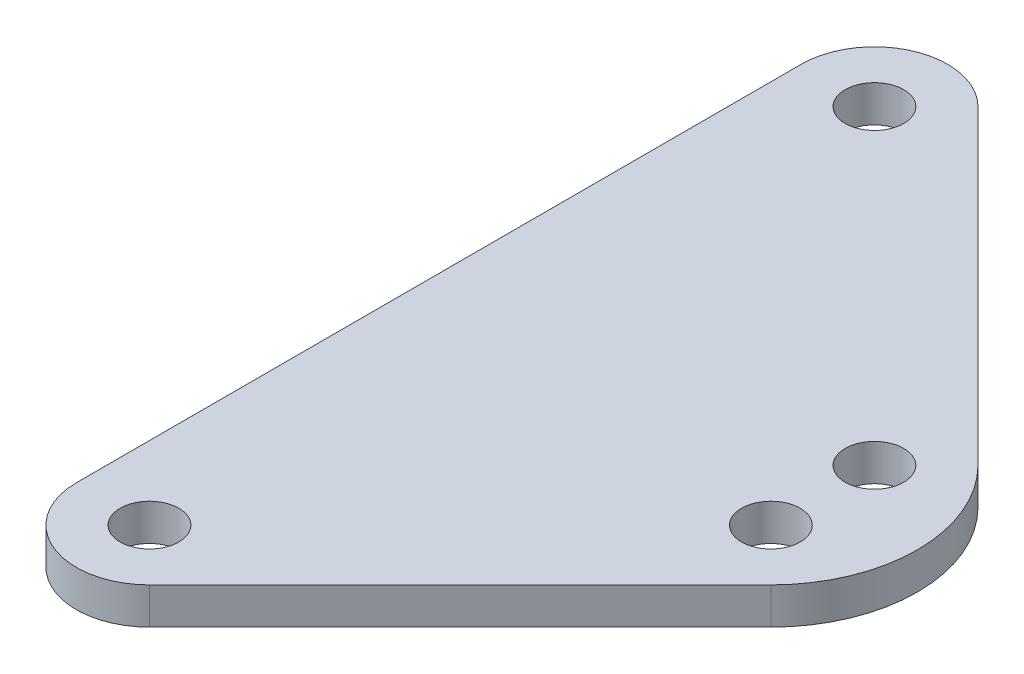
ISO-10303-21;
HEADER;
FILE_DESCRIPTION(('STEP AP214'),'2;1');
FILE_NAME('part.step','',(''),(''),'','','');
FILE_SCHEMA(('AUTOMOTIVE_DESIGN { 1 0 10303 214 1 1 1 1 }'));
ENDSEC;
DATA;
#1=APPLICATION_CONTEXT('core data for automotive mechanical design processes');
#2=APPLICATION_PROTOCOL_DEFINITION('international standard','automotive_design',2000,#1);
#3=PRODUCT_CONTEXT('',#1,'mechanical');
#4=PRODUCT('Part','Part','',(#3));
#5=PRODUCT_RELATED_PRODUCT_CATEGORY('part','',(#4));
#6=PRODUCT_DEFINITION_FORMATION('','',#4);
#7=PRODUCT_DEFINITION_CONTEXT('part definition',#1,'design');
#8=PRODUCT_DEFINITION('design','',#6,#7);
#9=PRODUCT_DEFINITION_SHAPE('','',#8);
#10=(LENGTH_UNIT() NAMED_UNIT(*) SI_UNIT(.MILLI.,.METRE.));
#11=(NAMED_UNIT(*) PLANE_ANGLE_UNIT() SI_UNIT($,.RADIAN.));
#12=(NAMED_UNIT(*) SI_UNIT($,.STERADIAN.) SOLID_ANGLE_UNIT());
#13=UNCERTAINTY_MEASURE_WITH_UNIT(LENGTH_MEASURE(1.E-05),#10,'distance_accuracy_value','');
#14=(GEOMETRIC_REPRESENTATION_CONTEXT(3) GLOBAL_UNCERTAINTY_ASSIGNED_CONTEXT((#13)) GLOBAL_UNIT_ASSIGNED_CONTEXT((#10,
#11,#12)) REPRESENTATION_CONTEXT('',''));
#15=CARTESIAN_POINT('',(0.,0.,0.));
#16=DIRECTION('',(0.,0.,1.));
#17=DIRECTION('',(1.,0.,0.));
#18=AXIS2_PLACEMENT_3D('',#15,#16,#17);
#19=CARTESIAN_POINT('',(90.7106781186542,10.,-147.279220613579));
#20=DIRECTION('',(0.,1.,0.));
#21=DIRECTION('',(0.,0.,1.));
#22=AXIS2_PLACEMENT_3D('',#19,#20,#21);
#23=PLANE('',#22);
#24=CARTESIAN_POINT('',(104.852813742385,10.,-161.42135623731));
#25=DIRECTION('',(0.,1.,0.));
#26=DIRECTION('',(0.,0.,1.));
#27=AXIS2_PLACEMENT_3D('',#24,#25,#26);
#28=CIRCLE('',#27,7.99999999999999);
#29=CARTESIAN_POINT('',(104.852813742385,10.,-153.42135623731));
#30=VERTEX_POINT('',#29);
#31=EDGE_CURVE('E194',#30,#30,#28,.T.);
#32=ORIENTED_EDGE('',*,*,#31,.F.);
#33=EDGE_LOOP('',(#32));
#34=FACE_BOUND('',#33,.T.);
#35=CARTESIAN_POINT('',(20.,10.,-48.2842712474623));
#36=DIRECTION('',(0.,1.,0.));
#37=DIRECTION('',(0.,0.,1.));
#38=AXIS2_PLACEMENT_3D('',#35,#36,#37);
#39=CIRCLE('',#38,8.);
#40=CARTESIAN_POINT('',(20.,10.,-40.2842712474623));
#41=VERTEX_POINT('',#40);
#42=EDGE_CURVE('E127',#41,#41,#39,.T.);
#43=ORIENTED_EDGE('',*,*,#42,.F.);
#44=EDGE_LOOP('',(#43));
#45=FACE_BOUND('',#44,.T.);
#46=CARTESIAN_POINT('',(90.7106781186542,10.,-147.279220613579));
#47=DIRECTION('',(0.,1.,0.));
#48=DIRECTION('',(0.,0.,1.));
#49=AXIS2_PLACEMENT_3D('',#46,#47,#48);
#50=CIRCLE('',#49,40.);
#51=CARTESIAN_POINT('',(118.994949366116,10.,-118.994949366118));
#52=VERTEX_POINT('',#51);
#53=CARTESIAN_POINT('',(118.994949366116,10.,-175.563491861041));
#54=VERTEX_POINT('',#53);
#55=EDGE_CURVE('E134',#52,#54,#50,.T.);
#56=ORIENTED_EDGE('',*,*,#55,.T.);
#57=DIRECTION('',(-0.707106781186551,0.,-0.707106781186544));
#58=VECTOR('',#57,1.);
#59=CARTESIAN_POINT('',(118.994949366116,10.,-175.563491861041));
#60=LINE('',#59,#58);
#61=CARTESIAN_POINT('',(34.1421356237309,10.,-260.416305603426));
#62=VERTEX_POINT('',#61);
#63=EDGE_CURVE('E92',#54,#62,#60,.T.);
#64=ORIENTED_EDGE('',*,*,#63,.T.);
#65=CARTESIAN_POINT('',(20.,10.,-246.274169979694));
#66=DIRECTION('',(0.,1.,0.));
#67=DIRECTION('',(0.,0.,1.));
#68=AXIS2_PLACEMENT_3D('',#65,#66,#67);
#69=CIRCLE('',#68,20.);
#70=CARTESIAN_POINT('',(0.,10.,-246.274169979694));
#71=VERTEX_POINT('',#70);
#72=EDGE_CURVE('E105',#62,#71,#69,.T.);
#73=ORIENTED_EDGE('',*,*,#72,.T.);
#74=DIRECTION('',(0.,0.,1.));
#75=VECTOR('',#74,1.);
#76=CARTESIAN_POINT('',(0.,10.,-246.274169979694));
#77=LINE('',#76,#75);
#78=CARTESIAN_POINT('',(0.,10.,-48.2842712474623));
#79=VERTEX_POINT('',#78);
#80=EDGE_CURVE('E99',#71,#79,#77,.T.);
#81=ORIENTED_EDGE('',*,*,#80,.T.);
#82=CARTESIAN_POINT('',(20.,10.,-48.2842712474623));
#83=DIRECTION('',(0.,1.,0.));
#84=DIRECTION('',(0.,0.,-1.));
#85=AXIS2_PLACEMENT_3D('',#82,#83,#84);
#86=CIRCLE('',#85,20.);
#87=CARTESIAN_POINT('',(34.1421356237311,10.,-34.1421356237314));
#88=VERTEX_POINT('',#87);
#89=EDGE_CURVE('E103',#79,#88,#86,.T.);
#90=ORIENTED_EDGE('',*,*,#89,.T.);
#91=DIRECTION('',(0.707106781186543,0.,-0.707106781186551));
#92=VECTOR('',#91,1.);
#93=CARTESIAN_POINT('',(34.1421356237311,10.,-34.1421356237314));
#94=LINE('',#93,#92);
#95=EDGE_CURVE('E55',#88,#52,#94,.T.);
#96=ORIENTED_EDGE('',*,*,#95,.T.);
#97=EDGE_LOOP('',(#56,#64,#73,#81,#90,#96));
#98=FACE_BOUND('',#97,.T.);
#99=CARTESIAN_POINT('',(104.852813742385,10.,-133.137084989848));
#100=DIRECTION('',(0.,1.,0.));
#101=DIRECTION('',(0.,0.,1.));
#102=AXIS2_PLACEMENT_3D('',#99,#100,#101);
#103=CIRCLE('',#102,8.00000000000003);
#104=CARTESIAN_POINT('',(104.852813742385,10.,-125.137084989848));
#105=VERTEX_POINT('',#104);
#106=EDGE_CURVE('E200',#105,#105,#103,.T.);
#107=ORIENTED_EDGE('',*,*,#106,.F.);
#108=EDGE_LOOP('',(#107));
#109=FACE_BOUND('',#108,.T.);
#110=CARTESIAN_POINT('',(19.9999999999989,10.,-246.274169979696));
#111=DIRECTION('',(0.,1.,0.));
#112=DIRECTION('',(0.,0.,1.));
#113=AXIS2_PLACEMENT_3D('',#110,#111,#112);
#114=CIRCLE('',#113,7.99999999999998);
#115=CARTESIAN_POINT('',(19.9999999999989,10.,-238.274169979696));
#116=VERTEX_POINT('',#115);
#117=EDGE_CURVE('E185',#116,#116,#114,.T.);
#118=ORIENTED_EDGE('',*,*,#117,.F.);
#119=EDGE_LOOP('',(#118));
#120=FACE_BOUND('',#119,.T.);
#121=ADVANCED_FACE('F38',(#34,#45,#98,#109,#120),#23,.T.);
#122=CARTESIAN_POINT('',(90.7106781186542,0.,-147.279220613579));
#123=DIRECTION('',(0.,1.,0.));
#124=DIRECTION('',(0.,0.,1.));
#125=AXIS2_PLACEMENT_3D('',#122,#123,#124);
#126=PLANE('',#125);
#127=CARTESIAN_POINT('',(90.7106781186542,0.,-147.279220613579));
#128=DIRECTION('',(0.,1.,0.));
#129=DIRECTION('',(0.,0.,1.));
#130=AXIS2_PLACEMENT_3D('',#127,#128,#129);
#131=CIRCLE('',#130,40.);
#132=CARTESIAN_POINT('',(118.994949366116,0.,-118.994949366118));
#133=VERTEX_POINT('',#132);
#134=CARTESIAN_POINT('',(118.994949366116,0.,-175.563491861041));
#135=VERTEX_POINT('',#134);
#136=EDGE_CURVE('E123',#133,#135,#131,.T.);
#137=ORIENTED_EDGE('',*,*,#136,.F.);
#138=DIRECTION('',(0.707106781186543,0.,-0.707106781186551));
#139=VECTOR('',#138,1.);
#140=CARTESIAN_POINT('',(34.1421356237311,0.,-34.1421356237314));
#141=LINE('',#140,#139);
#142=CARTESIAN_POINT('',(34.1421356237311,0.,-34.1421356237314));
#143=VERTEX_POINT('',#142);
#144=EDGE_CURVE('E84',#143,#133,#141,.T.);
#145=ORIENTED_EDGE('',*,*,#144,.F.);
#146=CARTESIAN_POINT('',(20.,0.,-48.2842712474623));
#147=DIRECTION('',(0.,1.,0.));
#148=DIRECTION('',(0.,0.,-1.));
#149=AXIS2_PLACEMENT_3D('',#146,#147,#148);
#150=CIRCLE('',#149,20.);
#151=CARTESIAN_POINT('',(0.,0.,-48.2842712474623));
#152=VERTEX_POINT('',#151);
#153=EDGE_CURVE('E78',#152,#143,#150,.T.);
#154=ORIENTED_EDGE('',*,*,#153,.F.);
#155=DIRECTION('',(0.,0.,1.));
#156=VECTOR('',#155,1.);
#157=CARTESIAN_POINT('',(0.,0.,-246.274169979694));
#158=LINE('',#157,#156);
#159=CARTESIAN_POINT('',(0.,0.,-246.274169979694));
#160=VERTEX_POINT('',#159);
#161=EDGE_CURVE('E113',#160,#152,#158,.T.);
#162=ORIENTED_EDGE('',*,*,#161,.F.);
#163=CARTESIAN_POINT('',(20.,0.,-246.274169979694));
#164=DIRECTION('',(0.,1.,0.));
#165=DIRECTION('',(0.,0.,1.));
#166=AXIS2_PLACEMENT_3D('',#163,#164,#165);
#167=CIRCLE('',#166,20.);
#168=CARTESIAN_POINT('',(34.1421356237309,0.,-260.416305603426));
#169=VERTEX_POINT('',#168);
#170=EDGE_CURVE('E129',#169,#160,#167,.T.);
#171=ORIENTED_EDGE('',*,*,#170,.F.);
#172=DIRECTION('',(-0.707106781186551,0.,-0.707106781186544));
#173=VECTOR('',#172,1.);
#174=CARTESIAN_POINT('',(118.994949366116,0.,-175.563491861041));
#175=LINE('',#174,#173);
#176=EDGE_CURVE('E126',#135,#169,#175,.T.);
#177=ORIENTED_EDGE('',*,*,#176,.F.);
#178=EDGE_LOOP('',(#137,#145,#154,#162,#171,#177));
#179=FACE_BOUND('',#178,.T.);
#180=CARTESIAN_POINT('',(20.,0.,-48.2842712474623));
#181=DIRECTION('',(0.,1.,0.));
#182=DIRECTION('',(0.,0.,1.));
#183=AXIS2_PLACEMENT_3D('',#180,#181,#182);
#184=CIRCLE('',#183,8.);
#185=CARTESIAN_POINT('',(20.,0.,-40.2842712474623));
#186=VERTEX_POINT('',#185);
#187=EDGE_CURVE('E203',#186,#186,#184,.T.);
#188=ORIENTED_EDGE('',*,*,#187,.T.);
#189=EDGE_LOOP('',(#188));
#190=FACE_BOUND('',#189,.T.);
#191=CARTESIAN_POINT('',(104.852813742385,0.,-133.137084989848));
#192=DIRECTION('',(0.,1.,0.));
#193=DIRECTION('',(0.,0.,1.));
#194=AXIS2_PLACEMENT_3D('',#191,#192,#193);
#195=CIRCLE('',#194,8.00000000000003);
#196=CARTESIAN_POINT('',(104.852813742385,0.,-125.137084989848));
#197=VERTEX_POINT('',#196);
#198=EDGE_CURVE('E197',#197,#197,#195,.T.);
#199=ORIENTED_EDGE('',*,*,#198,.T.);
#200=EDGE_LOOP('',(#199));
#201=FACE_BOUND('',#200,.T.);
#202=CARTESIAN_POINT('',(104.852813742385,0.,-161.42135623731));
#203=DIRECTION('',(0.,1.,0.));
#204=DIRECTION('',(0.,0.,1.));
#205=AXIS2_PLACEMENT_3D('',#202,#203,#204);
#206=CIRCLE('',#205,7.99999999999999);
#207=CARTESIAN_POINT('',(104.852813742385,0.,-153.42135623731));
#208=VERTEX_POINT('',#207);
#209=EDGE_CURVE('E191',#208,#208,#206,.T.);
#210=ORIENTED_EDGE('',*,*,#209,.T.);
#211=EDGE_LOOP('',(#210));
#212=FACE_BOUND('',#211,.T.);
#213=CARTESIAN_POINT('',(19.9999999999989,0.,-246.274169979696));
#214=DIRECTION('',(0.,1.,0.));
#215=DIRECTION('',(0.,0.,1.));
#216=AXIS2_PLACEMENT_3D('',#213,#214,#215);
#217=CIRCLE('',#216,7.99999999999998);
#218=CARTESIAN_POINT('',(19.9999999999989,0.,-238.274169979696));
#219=VERTEX_POINT('',#218);
#220=EDGE_CURVE('E188',#219,#219,#217,.T.);
#221=ORIENTED_EDGE('',*,*,#220,.T.);
#222=EDGE_LOOP('',(#221));
#223=FACE_BOUND('',#222,.T.);
#224=ADVANCED_FACE('F143',(#179,#190,#201,#212,#223),#126,.F.);
#225=CARTESIAN_POINT('',(90.7106781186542,10.,-147.279220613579));
#226=DIRECTION('',(0.,-1.,0.));
#227=DIRECTION('',(0.,0.,-1.));
#228=AXIS2_PLACEMENT_3D('',#225,#226,#227);
#229=CYLINDRICAL_SURFACE('',#228,40.);
#230=ORIENTED_EDGE('',*,*,#136,.T.);
#231=DIRECTION('',(0.,-1.,0.));
#232=VECTOR('',#231,1.);
#233=CARTESIAN_POINT('',(118.994949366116,10.,-175.563491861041));
#234=LINE('',#233,#232);
#235=EDGE_CURVE('E11',#54,#135,#234,.T.);
#236=ORIENTED_EDGE('',*,*,#235,.F.);
#237=ORIENTED_EDGE('',*,*,#55,.F.);
#238=DIRECTION('',(0.,-1.,0.));
#239=VECTOR('',#238,1.);
#240=CARTESIAN_POINT('',(118.994949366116,10.,-118.994949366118));
#241=LINE('',#240,#239);
#242=EDGE_CURVE('E119',#52,#133,#241,.T.);
#243=ORIENTED_EDGE('',*,*,#242,.T.);
#244=EDGE_LOOP('',(#230,#236,#237,#243));
#245=FACE_BOUND('',#244,.T.);
#246=ADVANCED_FACE('F40',(#245),#229,.T.);
#247=CARTESIAN_POINT('',(118.994949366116,10.,-175.563491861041));
#248=DIRECTION('',(-0.707106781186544,0.,0.707106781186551));
#249=DIRECTION('',(0.707106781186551,0.,0.707106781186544));
#250=AXIS2_PLACEMENT_3D('',#247,#248,#249);
#251=PLANE('',#250);
#252=ORIENTED_EDGE('',*,*,#176,.T.);
#253=DIRECTION('',(0.,-1.,0.));
#254=VECTOR('',#253,1.);
#255=CARTESIAN_POINT('',(34.1421356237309,10.,-260.416305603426));
#256=LINE('',#255,#254);
#257=EDGE_CURVE('E47',#62,#169,#256,.T.);
#258=ORIENTED_EDGE('',*,*,#257,.F.);
#259=ORIENTED_EDGE('',*,*,#63,.F.);
#260=ORIENTED_EDGE('',*,*,#235,.T.);
#261=EDGE_LOOP('',(#252,#258,#259,#260));
#262=FACE_BOUND('',#261,.T.);
#263=ADVANCED_FACE('F261',(#262),#251,.F.);
#264=CARTESIAN_POINT('',(20.,10.,-246.274169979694));
#265=DIRECTION('',(0.,-1.,0.));
#266=DIRECTION('',(0.,0.,-1.));
#267=AXIS2_PLACEMENT_3D('',#264,#265,#266);
#268=CYLINDRICAL_SURFACE('',#267,20.);
#269=ORIENTED_EDGE('',*,*,#170,.T.);
#270=DIRECTION('',(0.,-1.,0.));
#271=VECTOR('',#270,1.);
#272=CARTESIAN_POINT('',(0.,10.,-246.274169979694));
#273=LINE('',#272,#271);
#274=EDGE_CURVE('E114',#71,#160,#273,.T.);
#275=ORIENTED_EDGE('',*,*,#274,.F.);
#276=ORIENTED_EDGE('',*,*,#72,.F.);
#277=ORIENTED_EDGE('',*,*,#257,.T.);
#278=EDGE_LOOP('',(#269,#275,#276,#277));
#279=FACE_BOUND('',#278,.T.);
#280=ADVANCED_FACE('F140',(#279),#268,.T.);
#281=CARTESIAN_POINT('',(0.,10.,-246.274169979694));
#282=DIRECTION('',(1.,0.,0.));
#283=DIRECTION('',(0.,0.,-1.));
#284=AXIS2_PLACEMENT_3D('',#281,#282,#283);
#285=PLANE('',#284);
#286=ORIENTED_EDGE('',*,*,#161,.T.);
#287=DIRECTION('',(0.,-1.,0.));
#288=VECTOR('',#287,1.);
#289=CARTESIAN_POINT('',(0.,10.,-48.2842712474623));
#290=LINE('',#289,#288);
#291=EDGE_CURVE('E110',#79,#152,#290,.T.);
#292=ORIENTED_EDGE('',*,*,#291,.F.);
#293=ORIENTED_EDGE('',*,*,#80,.F.);
#294=ORIENTED_EDGE('',*,*,#274,.T.);
#295=EDGE_LOOP('',(#286,#292,#293,#294));
#296=FACE_BOUND('',#295,.T.);
#297=ADVANCED_FACE('F111',(#296),#285,.F.);
#298=CARTESIAN_POINT('',(20.,10.,-48.2842712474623));
#299=DIRECTION('',(0.,-1.,0.));
#300=DIRECTION('',(0.,0.,-1.));
#301=AXIS2_PLACEMENT_3D('',#298,#299,#300);
#302=CYLINDRICAL_SURFACE('',#301,20.);
#303=ORIENTED_EDGE('',*,*,#153,.T.);
#304=DIRECTION('',(0.,-1.,0.));
#305=VECTOR('',#304,1.);
#306=CARTESIAN_POINT('',(34.1421356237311,10.,-34.1421356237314));
#307=LINE('',#306,#305);
#308=EDGE_CURVE('E115',#88,#143,#307,.T.);
#309=ORIENTED_EDGE('',*,*,#308,.F.);
#310=ORIENTED_EDGE('',*,*,#89,.F.);
#311=ORIENTED_EDGE('',*,*,#291,.T.);
#312=EDGE_LOOP('',(#303,#309,#310,#311));
#313=FACE_BOUND('',#312,.T.);
#314=ADVANCED_FACE('F117',(#313),#302,.T.);
#315=CARTESIAN_POINT('',(34.1421356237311,10.,-34.1421356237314));
#316=DIRECTION('',(-0.707106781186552,0.,-0.707106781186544));
#317=DIRECTION('',(-0.707106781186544,0.,0.707106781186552));
#318=AXIS2_PLACEMENT_3D('',#315,#316,#317);
#319=PLANE('',#318);
#320=ORIENTED_EDGE('',*,*,#144,.T.);
#321=ORIENTED_EDGE('',*,*,#242,.F.);
#322=ORIENTED_EDGE('',*,*,#95,.F.);
#323=ORIENTED_EDGE('',*,*,#308,.T.);
#324=EDGE_LOOP('',(#320,#321,#322,#323));
#325=FACE_BOUND('',#324,.T.);
#326=ADVANCED_FACE('F148',(#325),#319,.F.);
#327=CARTESIAN_POINT('',(20.,10.,-48.2842712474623));
#328=DIRECTION('',(0.,-1.,0.));
#329=DIRECTION('',(0.,0.,-1.));
#330=AXIS2_PLACEMENT_3D('',#327,#328,#329);
#331=CYLINDRICAL_SURFACE('',#330,8.);
#332=ORIENTED_EDGE('',*,*,#42,.T.);
#333=EDGE_LOOP('',(#332));
#334=FACE_BOUND('',#333,.T.);
#335=ORIENTED_EDGE('',*,*,#187,.F.);
#336=EDGE_LOOP('',(#335));
#337=FACE_BOUND('',#336,.T.);
#338=ADVANCED_FACE('F150',(#334,#337),#331,.F.);
#339=CARTESIAN_POINT('',(104.852813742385,10.,-133.137084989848));
#340=DIRECTION('',(0.,-1.,0.));
#341=DIRECTION('',(0.,0.,-1.));
#342=AXIS2_PLACEMENT_3D('',#339,#340,#341);
#343=CYLINDRICAL_SURFACE('',#342,8.00000000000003);
#344=ORIENTED_EDGE('',*,*,#106,.T.);
#345=EDGE_LOOP('',(#344));
#346=FACE_BOUND('',#345,.T.);
#347=ORIENTED_EDGE('',*,*,#198,.F.);
#348=EDGE_LOOP('',(#347));
#349=FACE_BOUND('',#348,.T.);
#350=ADVANCED_FACE('F156',(#346,#349),#343,.F.);
#351=CARTESIAN_POINT('',(104.852813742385,10.,-161.42135623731));
#352=DIRECTION('',(0.,-1.,0.));
#353=DIRECTION('',(0.,0.,-1.));
#354=AXIS2_PLACEMENT_3D('',#351,#352,#353);
#355=CYLINDRICAL_SURFACE('',#354,7.99999999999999);
#356=ORIENTED_EDGE('',*,*,#31,.T.);
#357=EDGE_LOOP('',(#356));
#358=FACE_BOUND('',#357,.T.);
#359=ORIENTED_EDGE('',*,*,#209,.F.);
#360=EDGE_LOOP('',(#359));
#361=FACE_BOUND('',#360,.T.);
#362=ADVANCED_FACE('F172',(#358,#361),#355,.F.);
#363=CARTESIAN_POINT('',(19.9999999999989,10.,-246.274169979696));
#364=DIRECTION('',(0.,-1.,0.));
#365=DIRECTION('',(0.,0.,-1.));
#366=AXIS2_PLACEMENT_3D('',#363,#364,#365);
#367=CYLINDRICAL_SURFACE('',#366,7.99999999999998);
#368=ORIENTED_EDGE('',*,*,#117,.T.);
#369=EDGE_LOOP('',(#368));
#370=FACE_BOUND('',#369,.T.);
#371=ORIENTED_EDGE('',*,*,#220,.F.);
#372=EDGE_LOOP('',(#371));
#373=FACE_BOUND('',#372,.T.);
#374=ADVANCED_FACE('F176',(#370,#373),#367,.F.);
#375=CLOSED_SHELL('',(#121,#224,#246,#263,#280,#297,#314,#326,#338,#350,#362,#374));
#376=MANIFOLD_SOLID_BREP('B2',#375);
#377=ADVANCED_BREP_SHAPE_REPRESENTATION('',(#18,#376),#14);
#378=SHAPE_DEFINITION_REPRESENTATION(#9,#377);
ENDSEC;
END-ISO-10303-21;
